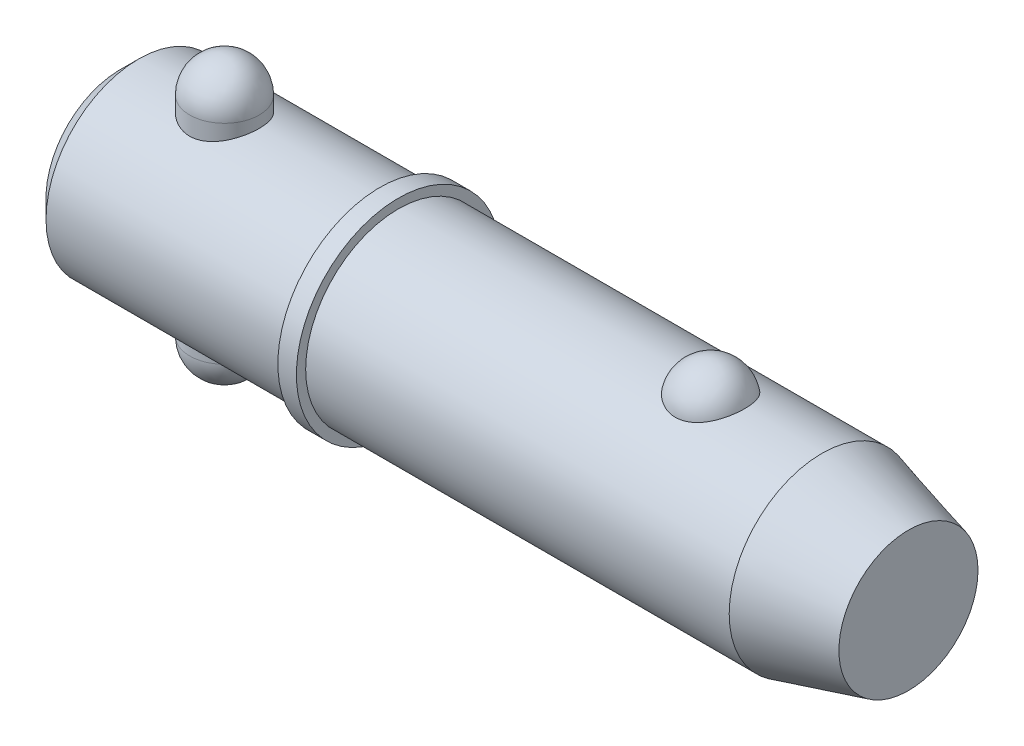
ISO-10303-21;
HEADER;
FILE_DESCRIPTION(('STEP AP214'),'2;1');
FILE_NAME('part.step','',(''),(''),'','','');
FILE_SCHEMA(('AUTOMOTIVE_DESIGN { 1 0 10303 214 1 1 1 1 }'));
ENDSEC;
DATA;
#1=APPLICATION_CONTEXT('core data for automotive mechanical design processes');
#2=APPLICATION_PROTOCOL_DEFINITION('international standard','automotive_design',2000,#1);
#3=PRODUCT_CONTEXT('',#1,'mechanical');
#4=PRODUCT('Part','Part','',(#3));
#5=PRODUCT_RELATED_PRODUCT_CATEGORY('part','',(#4));
#6=PRODUCT_DEFINITION_FORMATION('','',#4);
#7=PRODUCT_DEFINITION_CONTEXT('part definition',#1,'design');
#8=PRODUCT_DEFINITION('design','',#6,#7);
#9=PRODUCT_DEFINITION_SHAPE('','',#8);
#10=(LENGTH_UNIT() NAMED_UNIT(*) SI_UNIT(.MILLI.,.METRE.));
#11=(NAMED_UNIT(*) PLANE_ANGLE_UNIT() SI_UNIT($,.RADIAN.));
#12=(NAMED_UNIT(*) SI_UNIT($,.STERADIAN.) SOLID_ANGLE_UNIT());
#13=UNCERTAINTY_MEASURE_WITH_UNIT(LENGTH_MEASURE(1.E-05),#10,'distance_accuracy_value','');
#14=(GEOMETRIC_REPRESENTATION_CONTEXT(3) GLOBAL_UNCERTAINTY_ASSIGNED_CONTEXT((#13)) GLOBAL_UNIT_ASSIGNED_CONTEXT((#10,
#11,#12)) REPRESENTATION_CONTEXT('',''));
#15=CARTESIAN_POINT('',(0.,0.,0.));
#16=DIRECTION('',(0.,0.,1.));
#17=DIRECTION('',(1.,0.,0.));
#18=AXIS2_PLACEMENT_3D('',#15,#16,#17);
#19=CARTESIAN_POINT('',(14.28,19.05,0.));
#20=DIRECTION('',(0.,-1.,0.));
#21=DIRECTION('',(0.,0.,-1.));
#22=AXIS2_PLACEMENT_3D('',#19,#20,#21);
#23=CYLINDRICAL_SURFACE('',#22,4.76);
#24=CARTESIAN_POINT('',(14.28,-14.29,0.));
#25=DIRECTION('',(0.,-1.,0.));
#26=DIRECTION('',(0.,0.,-1.));
#27=AXIS2_PLACEMENT_3D('',#24,#25,#26);
#28=CIRCLE('',#27,4.76);
#29=CARTESIAN_POINT('',(14.28,-14.29,-4.76));
#30=VERTEX_POINT('',#29);
#31=EDGE_CURVE('P0_E10',#30,#30,#28,.F.);
#32=CARTESIAN_POINT('',(14.28,14.29,0.));
#33=DIRECTION('',(0.,-1.,0.));
#34=DIRECTION('',(0.,0.,-1.));
#35=AXIS2_PLACEMENT_3D('',#32,#33,#34);
#36=CIRCLE('',#35,4.76);
#37=CARTESIAN_POINT('',(14.28,14.29,-4.76));
#38=VERTEX_POINT('',#37);
#39=EDGE_CURVE('P0_E21',#38,#38,#36,.T.);
#40=CARTESIAN_POINT('',(14.28,-14.29,-4.76));
#41=CARTESIAN_POINT('',(14.28,-13.9922916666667,-4.76));
#42=CARTESIAN_POINT('',(14.28,-13.6945833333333,-4.76));
#43=CARTESIAN_POINT('',(14.28,-13.0991666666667,-4.76));
#44=CARTESIAN_POINT('',(14.28,-12.8014583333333,-4.76));
#45=CARTESIAN_POINT('',(14.28,-12.2060416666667,-4.76));
#46=CARTESIAN_POINT('',(14.28,-11.9083333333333,-4.76));
#47=CARTESIAN_POINT('',(14.28,-11.3129166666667,-4.76));
#48=CARTESIAN_POINT('',(14.28,-11.0152083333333,-4.76));
#49=CARTESIAN_POINT('',(14.28,-10.4197916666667,-4.76));
#50=CARTESIAN_POINT('',(14.28,-10.1220833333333,-4.76));
#51=CARTESIAN_POINT('',(14.28,-9.52666666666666,-4.76));
#52=CARTESIAN_POINT('',(14.28,-9.22895833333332,-4.76));
#53=CARTESIAN_POINT('',(14.28,-8.63354166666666,-4.76));
#54=CARTESIAN_POINT('',(14.28,-8.33583333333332,-4.76));
#55=CARTESIAN_POINT('',(14.28,-7.74041666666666,-4.76));
#56=CARTESIAN_POINT('',(14.28,-7.44270833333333,-4.76));
#57=CARTESIAN_POINT('',(14.28,-6.84729166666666,-4.76));
#58=CARTESIAN_POINT('',(14.28,-6.54958333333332,-4.76));
#59=CARTESIAN_POINT('',(14.28,-5.95416666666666,-4.76));
#60=CARTESIAN_POINT('',(14.28,-5.65645833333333,-4.76));
#61=CARTESIAN_POINT('',(14.28,-5.06104166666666,-4.76));
#62=CARTESIAN_POINT('',(14.28,-4.76333333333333,-4.76));
#63=CARTESIAN_POINT('',(14.28,-4.16791666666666,-4.76));
#64=CARTESIAN_POINT('',(14.28,-3.87020833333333,-4.76));
#65=CARTESIAN_POINT('',(14.28,-3.27479166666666,-4.76));
#66=CARTESIAN_POINT('',(14.28,-2.97708333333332,-4.76));
#67=CARTESIAN_POINT('',(14.28,-2.38166666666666,-4.76));
#68=CARTESIAN_POINT('',(14.28,-2.08395833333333,-4.76));
#69=CARTESIAN_POINT('',(14.28,-1.48854166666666,-4.76));
#70=CARTESIAN_POINT('',(14.28,-1.19083333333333,-4.76));
#71=CARTESIAN_POINT('',(14.28,-0.595416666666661,-4.76));
#72=CARTESIAN_POINT('',(14.28,-0.297708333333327,-4.76));
#73=CARTESIAN_POINT('',(14.28,0.297708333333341,-4.76));
#74=CARTESIAN_POINT('',(14.28,0.595416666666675,-4.76));
#75=CARTESIAN_POINT('',(14.28,1.19083333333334,-4.76));
#76=CARTESIAN_POINT('',(14.28,1.48854166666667,-4.76));
#77=CARTESIAN_POINT('',(14.28,2.08395833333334,-4.76));
#78=CARTESIAN_POINT('',(14.28,2.38166666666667,-4.76));
#79=CARTESIAN_POINT('',(14.28,2.97708333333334,-4.76));
#80=CARTESIAN_POINT('',(14.28,3.27479166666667,-4.76));
#81=CARTESIAN_POINT('',(14.28,3.87020833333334,-4.76));
#82=CARTESIAN_POINT('',(14.28,4.16791666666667,-4.76));
#83=CARTESIAN_POINT('',(14.28,4.76333333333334,-4.76));
#84=CARTESIAN_POINT('',(14.28,5.06104166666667,-4.76));
#85=CARTESIAN_POINT('',(14.28,5.65645833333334,-4.76));
#86=CARTESIAN_POINT('',(14.28,5.95416666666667,-4.76));
#87=CARTESIAN_POINT('',(14.28,6.54958333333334,-4.76));
#88=CARTESIAN_POINT('',(14.28,6.84729166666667,-4.76));
#89=CARTESIAN_POINT('',(14.28,7.44270833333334,-4.76));
#90=CARTESIAN_POINT('',(14.28,7.74041666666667,-4.76));
#91=CARTESIAN_POINT('',(14.28,8.33583333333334,-4.76));
#92=CARTESIAN_POINT('',(14.28,8.63354166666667,-4.76));
#93=CARTESIAN_POINT('',(14.28,9.22895833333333,-4.76));
#94=CARTESIAN_POINT('',(14.28,9.52666666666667,-4.76));
#95=CARTESIAN_POINT('',(14.28,10.1220833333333,-4.76));
#96=CARTESIAN_POINT('',(14.28,10.4197916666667,-4.76));
#97=CARTESIAN_POINT('',(14.28,11.0152083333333,-4.76));
#98=CARTESIAN_POINT('',(14.28,11.3129166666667,-4.76));
#99=CARTESIAN_POINT('',(14.28,11.9083333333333,-4.76));
#100=CARTESIAN_POINT('',(14.28,12.2060416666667,-4.76));
#101=CARTESIAN_POINT('',(14.28,12.8014583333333,-4.76));
#102=CARTESIAN_POINT('',(14.28,13.0991666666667,-4.76));
#103=CARTESIAN_POINT('',(14.28,13.6945833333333,-4.76));
#104=CARTESIAN_POINT('',(14.28,13.9922916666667,-4.76));
#105=CARTESIAN_POINT('',(14.28,14.29,-4.76));
#106=B_SPLINE_CURVE_WITH_KNOTS('',3,(#40,#41,#42,#43,#44,#45,#46,#47,#48,#49,#50,#51,#52,#53,
#54,#55,#56,#57,#58,#59,#60,#61,#62,#63,#64,#65,#66,#67,#68,#69,#70,#71,#72,#73,#74,#75,#76,#77,
#78,#79,#80,#81,#82,#83,#84,#85,#86,#87,#88,#89,#90,#91,#92,#93,#94,#95,#96,#97,#98,#99,#100,
#101,#102,#103,#104,#105),.UNSPECIFIED.,.F.,.F.,(4,2,2,2,2,2,2,2,2,2,2,2,2,2,2,2,2,2,2,2,2,2,2,
2,2,2,2,2,2,2,2,2,4),(0.,0.893125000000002,1.78625,2.67937499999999,3.5725,4.465625,5.35875,
6.25187499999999,7.145,8.038125,8.93125,9.82437499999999,10.7175,11.610625,12.50375,13.396875,
14.29,15.183125,16.07625,16.969375,17.8625,18.755625,19.64875,20.541875,21.435,22.328125,
23.22125,24.114375,25.0075,25.900625,26.79375,27.686875,28.58),.UNSPECIFIED.);
#107=EDGE_CURVE('P0_BSEAM14',#30,#38,#106,.T.);
#108=ORIENTED_EDGE('',*,*,#31,.T.);
#109=ORIENTED_EDGE('',*,*,#39,.T.);
#110=ORIENTED_EDGE('',*,*,#107,.T.);
#111=ORIENTED_EDGE('',*,*,#107,.F.);
#112=EDGE_LOOP('',(#108,#110,#109,#111));
#113=FACE_BOUND('',#112,.T.);
#114=ADVANCED_FACE('P0_F14',(#113),#23,.T.);
#115=CARTESIAN_POINT('',(14.28,-14.29,0.));
#116=DIRECTION('',(0.,0.,1.));
#117=DIRECTION('',(1.,0.,0.));
#118=AXIS2_PLACEMENT_3D('',#115,#116,#117);
#119=SPHERICAL_SURFACE('',#118,4.76);
#120=CARTESIAN_POINT('',(14.28,-14.29,0.));
#121=DIRECTION('',(0.,-1.,0.));
#122=DIRECTION('',(0.,0.,-1.));
#123=AXIS2_PLACEMENT_3D('',#120,#121,#122);
#124=SPHERICAL_SURFACE('',#123,4.76);
#125=ORIENTED_EDGE('',*,*,#31,.F.);
#126=EDGE_LOOP('',(#125));
#127=FACE_BOUND('',#126,.T.);
#128=ADVANCED_FACE('P0_F29',(#127),#124,.T.);
#129=CARTESIAN_POINT('',(14.28,14.29,0.));
#130=DIRECTION('',(0.,0.,1.));
#131=DIRECTION('',(1.,0.,0.));
#132=AXIS2_PLACEMENT_3D('',#129,#130,#131);
#133=SPHERICAL_SURFACE('',#132,4.76);
#134=CARTESIAN_POINT('',(14.28,14.29,0.));
#135=DIRECTION('',(0.,-1.,0.));
#136=DIRECTION('',(0.,0.,-1.));
#137=AXIS2_PLACEMENT_3D('',#134,#135,#136);
#138=SPHERICAL_SURFACE('',#137,4.76);
#139=ORIENTED_EDGE('',*,*,#39,.F.);
#140=EDGE_LOOP('',(#139));
#141=FACE_BOUND('',#140,.T.);
#142=ADVANCED_FACE('P0_F16',(#141),#138,.T.);
#143=CLOSED_SHELL('',(#114,#128,#142));
#144=MANIFOLD_SOLID_BREP('P0_B1',#143);
#145=CARTESIAN_POINT('',(0.,0.,0.));
#146=DIRECTION('',(1.,0.,0.));
#147=DIRECTION('',(0.,0.,-1.));
#148=AXIS2_PLACEMENT_3D('',#145,#146,#147);
#149=CYLINDRICAL_SURFACE('',#148,12.7);
#150=CARTESIAN_POINT('',(96.1007386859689,0.,0.));
#151=DIRECTION('',(1.,0.,0.));
#152=DIRECTION('',(0.,0.,-1.));
#153=AXIS2_PLACEMENT_3D('',#150,#151,#152);
#154=CIRCLE('',#153,12.7);
#155=CARTESIAN_POINT('',(96.1007386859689,0.,-12.7));
#156=VERTEX_POINT('',#155);
#157=EDGE_CURVE('P1_E81',#156,#156,#154,.T.);
#158=ORIENTED_EDGE('',*,*,#157,.F.);
#159=EDGE_LOOP('',(#158));
#160=FACE_BOUND('',#159,.T.);
#161=CARTESIAN_POINT('',(38.1,0.,0.));
#162=DIRECTION('',(1.,0.,0.));
#163=DIRECTION('',(0.,0.,-1.));
#164=AXIS2_PLACEMENT_3D('',#161,#162,#163);
#165=CIRCLE('',#164,12.7);
#166=CARTESIAN_POINT('',(38.1,0.,-12.7));
#167=VERTEX_POINT('',#166);
#168=EDGE_CURVE('P1_E85',#167,#167,#165,.T.);
#169=ORIENTED_EDGE('',*,*,#168,.T.);
#170=EDGE_LOOP('',(#169));
#171=FACE_BOUND('',#170,.T.);
#172=CARTESIAN_POINT('',(80.8600429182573,11.7500437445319,4.81938502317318));
#173=CARTESIAN_POINT('',(80.7350881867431,11.7500430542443,4.81938571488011));
#174=CARTESIAN_POINT('',(80.610144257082,11.7520975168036,4.81438658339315));
#175=CARTESIAN_POINT('',(80.3611425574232,11.760253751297,4.79442904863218));
#176=CARTESIAN_POINT('',(80.2370850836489,11.7663568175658,4.77946746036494));
#177=CARTESIAN_POINT('',(79.9909016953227,11.7824262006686,4.73971414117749));
#178=CARTESIAN_POINT('',(79.8687744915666,11.7923898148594,4.71492928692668));
#179=CARTESIAN_POINT('',(79.6271874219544,11.8158938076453,4.65571340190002));
#180=CARTESIAN_POINT('',(79.5077285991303,11.8294355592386,4.6212786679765));
#181=CARTESIAN_POINT('',(79.2725578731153,11.8596812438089,4.54309502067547));
#182=CARTESIAN_POINT('',(79.1568393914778,11.8763792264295,4.49936361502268));
#183=CARTESIAN_POINT('',(78.9296530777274,11.9124878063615,4.40287235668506));
#184=CARTESIAN_POINT('',(78.8181868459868,11.9318994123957,4.35010914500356));
#185=CARTESIAN_POINT('',(78.4912782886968,11.9934256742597,4.17881316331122));
#186=CARTESIAN_POINT('',(78.2831270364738,12.038858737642,4.04720756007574));
#187=CARTESIAN_POINT('',(77.8858509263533,12.1352173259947,3.748564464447));
#188=CARTESIAN_POINT('',(77.6974438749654,12.1862630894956,3.58061821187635));
#189=CARTESIAN_POINT('',(77.3505213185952,12.2875163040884,3.21600758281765));
#190=CARTESIAN_POINT('',(77.1920113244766,12.3377235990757,3.0193379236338));
#191=CARTESIAN_POINT('',(76.9016887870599,12.4344923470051,2.592916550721));
#192=CARTESIAN_POINT('',(76.7713762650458,12.4807925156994,2.36208286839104));
#193=CARTESIAN_POINT('',(76.5494079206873,12.5623454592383,1.88070399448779));
#194=CARTESIAN_POINT('',(76.4577554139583,12.5975972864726,1.63015711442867));
#195=CARTESIAN_POINT('',(76.3140466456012,12.6538414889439,1.1129886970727));
#196=CARTESIAN_POINT('',(76.2624990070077,12.6746503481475,0.846205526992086));
#197=CARTESIAN_POINT('',(76.2019771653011,12.699153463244,0.307085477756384));
#198=CARTESIAN_POINT('',(76.1930018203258,12.7028481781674,0.034748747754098));
#199=CARTESIAN_POINT('',(76.2177310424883,12.6927785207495,-0.506073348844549));
#200=CARTESIAN_POINT('',(76.2511899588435,12.6791146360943,-0.774571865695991));
#201=CARTESIAN_POINT('',(76.3596877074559,12.635882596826,-1.30170246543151));
#202=CARTESIAN_POINT('',(76.4347272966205,12.606314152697,-1.5603343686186));
#203=CARTESIAN_POINT('',(76.6250000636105,12.5342328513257,-2.06083899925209));
#204=CARTESIAN_POINT('',(76.7402872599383,12.4917026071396,-2.3026886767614));
#205=CARTESIAN_POINT('',(77.0087044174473,12.3981123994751,-2.76259600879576));
#206=CARTESIAN_POINT('',(77.1618374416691,12.3470517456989,-2.98065173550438));
#207=CARTESIAN_POINT('',(77.5035077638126,12.2416045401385,-3.38786328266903));
#208=CARTESIAN_POINT('',(77.6922017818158,12.1872040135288,-3.57688418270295));
#209=CARTESIAN_POINT('',(78.1002392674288,12.0814086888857,-3.91941073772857));
#210=CARTESIAN_POINT('',(78.3195800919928,12.0300136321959,-4.07291945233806));
#211=CARTESIAN_POINT('',(78.7783753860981,11.9373542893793,-4.33691289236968));
#212=CARTESIAN_POINT('',(79.0173044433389,11.8958982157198,-4.44824125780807));
#213=CARTESIAN_POINT('',(79.5124376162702,11.8268116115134,-4.62881985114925));
#214=CARTESIAN_POINT('',(79.7686351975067,11.7991758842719,-4.69808589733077));
#215=CARTESIAN_POINT('',(80.2771640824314,11.7622209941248,-4.78983181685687));
#216=CARTESIAN_POINT('',(80.5290414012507,11.7520502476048,-4.81449025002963));
#217=CARTESIAN_POINT('',(81.0335734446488,11.7485796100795,-4.82295735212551));
#218=CARTESIAN_POINT('',(81.2862280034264,11.7552763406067,-4.80677420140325));
#219=CARTESIAN_POINT('',(81.7768341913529,11.7842584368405,-4.73525430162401));
#220=CARTESIAN_POINT('',(82.0149984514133,11.8060486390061,-4.68116061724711));
#221=CARTESIAN_POINT('',(82.4784894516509,11.8622750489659,-4.53678133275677));
#222=CARTESIAN_POINT('',(82.7038151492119,11.8967122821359,-4.44649279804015));
#223=CARTESIAN_POINT('',(83.1408018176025,11.9754603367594,-4.2298761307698));
#224=CARTESIAN_POINT('',(83.3520579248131,12.0199699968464,-4.10280539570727));
#225=CARTESIAN_POINT('',(83.7506012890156,12.1138028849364,-3.81685409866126));
#226=CARTESIAN_POINT('',(83.9378830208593,12.163127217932,-3.65796622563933));
#227=CARTESIAN_POINT('',(84.2933509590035,12.2642343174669,-3.30364864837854));
#228=CARTESIAN_POINT('',(84.4601119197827,12.3160165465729,-3.10678783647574));
#229=CARTESIAN_POINT('',(84.7595799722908,12.4142566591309,-2.68748409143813));
#230=CARTESIAN_POINT('',(84.8922809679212,12.4607135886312,-2.46503658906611));
#231=CARTESIAN_POINT('',(85.1246912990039,12.5450236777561,-1.99289519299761));
#232=CARTESIAN_POINT('',(85.223215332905,12.5825557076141,-1.7425591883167));
#233=CARTESIAN_POINT('',(85.3792277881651,12.6431720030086,-1.22773734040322));
#234=CARTESIAN_POINT('',(85.4367157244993,12.6662560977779,-0.963251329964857));
#235=CARTESIAN_POINT('',(85.5095441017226,12.6956486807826,-0.427355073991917));
#236=CARTESIAN_POINT('',(85.5248378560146,12.7019385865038,-0.1559374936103));
#237=CARTESIAN_POINT('',(85.5127794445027,12.6970201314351,0.385928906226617));
#238=CARTESIAN_POINT('',(85.4854280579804,12.6858120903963,0.656377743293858));
#239=CARTESIAN_POINT('',(85.4130609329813,12.6568455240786,1.05454017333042));
#240=CARTESIAN_POINT('',(85.3837963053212,12.6451962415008,1.18577850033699));
#241=CARTESIAN_POINT('',(85.3150228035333,12.6181819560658,1.4451380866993));
#242=CARTESIAN_POINT('',(85.2755176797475,12.6028183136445,1.57326046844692));
#243=CARTESIAN_POINT('',(85.1864397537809,12.5687547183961,1.82554978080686));
#244=CARTESIAN_POINT('',(85.1368627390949,12.5500533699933,1.9497150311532));
#245=CARTESIAN_POINT('',(85.0279211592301,12.5098093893,2.19314370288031));
#246=CARTESIAN_POINT('',(84.9685601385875,12.4882677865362,2.31240887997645));
#247=CARTESIAN_POINT('',(84.8399712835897,12.4427679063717,2.54593031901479));
#248=CARTESIAN_POINT('',(84.7706888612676,12.4187964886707,2.66015396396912));
#249=CARTESIAN_POINT('',(84.622903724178,12.3691892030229,2.88202659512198));
#250=CARTESIAN_POINT('',(84.5444044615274,12.3435539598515,2.98967802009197));
#251=CARTESIAN_POINT('',(84.3785502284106,12.2912955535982,3.19774385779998));
#252=CARTESIAN_POINT('',(84.2911918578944,12.2646720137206,3.29815546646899));
#253=CARTESIAN_POINT('',(84.1081617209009,12.2111945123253,3.49095035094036));
#254=CARTESIAN_POINT('',(84.0124932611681,12.1843406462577,3.58333679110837));
#255=CARTESIAN_POINT('',(83.8136272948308,12.1312249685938,3.75922876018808));
#256=CARTESIAN_POINT('',(83.7104503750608,12.104961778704,3.84275713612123));
#257=CARTESIAN_POINT('',(83.4970133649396,12.0537284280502,4.00056406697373));
#258=CARTESIAN_POINT('',(83.3867562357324,12.028757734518,4.07484645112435));
#259=CARTESIAN_POINT('',(83.1597550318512,11.9808306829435,4.21367959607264));
#260=CARTESIAN_POINT('',(83.0430068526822,11.9578756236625,4.27822410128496));
#261=CARTESIAN_POINT('',(82.8039425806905,11.9147184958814,4.39698483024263));
#262=CARTESIAN_POINT('',(82.6816287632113,11.894515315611,4.45120522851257));
#263=CARTESIAN_POINT('',(82.422952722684,11.8561129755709,4.55255353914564));
#264=CARTESIAN_POINT('',(82.2862237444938,11.8381764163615,4.59884858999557));
#265=CARTESIAN_POINT('',(82.0086087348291,11.8069093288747,4.67853897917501));
#266=CARTESIAN_POINT('',(81.8677245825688,11.7935767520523,4.71194005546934));
#267=CARTESIAN_POINT('',(81.5830944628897,11.7720277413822,4.76552188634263));
#268=CARTESIAN_POINT('',(81.4393488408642,11.7638106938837,4.78570422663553));
#269=CARTESIAN_POINT('',(81.1504114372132,11.7528195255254,4.81263433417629));
#270=CARTESIAN_POINT('',(81.0052198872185,11.7500445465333,4.81938421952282));
#271=CARTESIAN_POINT('',(80.8600429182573,11.7500437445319,4.81938502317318));
#272=B_SPLINE_CURVE_WITH_KNOTS('',3,(#172,#173,#174,#175,#176,#177,#178,#179,#180,#181,#182,
#183,#184,#185,#186,#187,#188,#189,#190,#191,#192,#193,#194,#195,#196,#197,#198,#199,#200,#201,
#202,#203,#204,#205,#206,#207,#208,#209,#210,#211,#212,#213,#214,#215,#216,#217,#218,#219,#220,
#221,#222,#223,#224,#225,#226,#227,#228,#229,#230,#231,#232,#233,#234,#235,#236,#237,#238,#239,
#240,#241,#242,#243,#244,#245,#246,#247,#248,#249,#250,#251,#252,#253,#254,#255,#256,#257,#258,
#259,#260,#261,#262,#263,#264,#265,#266,#267,#268,#269,#270,#271),.UNSPECIFIED.,.T.,.F.,(4,2,2,
2,2,2,2,2,2,2,2,2,2,2,2,2,2,2,2,2,2,2,2,2,2,2,2,2,2,2,2,2,2,2,2,2,2,2,2,2,2,2,2,2,2,2,2,2,2,4),
(0.,0.374729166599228,0.749578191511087,1.12416526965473,1.49889629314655,1.87292776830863,
2.24709865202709,2.99481328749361,3.76399449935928,4.53331735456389,5.33683915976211,
6.14042986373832,6.95405296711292,7.76765424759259,8.57656703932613,9.38549455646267,
10.1955119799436,11.0055949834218,11.8193353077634,12.6330054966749,13.4294141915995,
14.2255231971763,14.9815786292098,15.7374826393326,16.4696948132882,17.2019663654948,
17.9501979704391,18.6986017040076,19.484470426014,20.2704797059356,21.0815215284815,
21.8925729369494,22.7045213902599,23.5164550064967,23.9209608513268,24.3253187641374,
24.7298461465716,25.1342272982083,25.54092555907,25.9474719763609,26.3541750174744,
26.7607169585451,27.1661834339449,27.5714814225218,27.9770386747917,28.3824315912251,
28.8181206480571,29.2536155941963,29.6890582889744,30.1244323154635),.UNSPECIFIED.);
#273=CARTESIAN_POINT('',(80.8600429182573,11.7500437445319,4.81938502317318));
#274=VERTEX_POINT('',#273);
#275=EDGE_CURVE('P1_E35',#274,#274,#272,.T.);
#276=ORIENTED_EDGE('',*,*,#275,.T.);
#277=EDGE_LOOP('',(#276));
#278=FACE_BOUND('',#277,.T.);
#279=ADVANCED_FACE('P1_F13',(#160,#171,#278),#149,.T.);
#280=CARTESIAN_POINT('',(0.,0.,0.));
#281=DIRECTION('',(-1.,0.,0.));
#282=DIRECTION('',(0.,0.,1.));
#283=AXIS2_PLACEMENT_3D('',#280,#281,#282);
#284=PLANE('',#283);
#285=CARTESIAN_POINT('',(0.,0.,0.));
#286=DIRECTION('',(1.,0.,0.));
#287=DIRECTION('',(0.,0.,-1.));
#288=AXIS2_PLACEMENT_3D('',#285,#286,#287);
#289=CIRCLE('',#288,10.16);
#290=CARTESIAN_POINT('',(0.,0.,-10.16));
#291=VERTEX_POINT('',#290);
#292=EDGE_CURVE('P1_E9',#291,#291,#289,.T.);
#293=ORIENTED_EDGE('',*,*,#292,.F.);
#294=EDGE_LOOP('',(#293));
#295=FACE_BOUND('',#294,.T.);
#296=ADVANCED_FACE('P1_F15',(#295),#284,.T.);
#297=CARTESIAN_POINT('',(2.53999999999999,0.,0.));
#298=DIRECTION('',(1.,0.,0.));
#299=DIRECTION('',(0.,0.,-1.));
#300=AXIS2_PLACEMENT_3D('',#297,#298,#299);
#301=CONICAL_SURFACE('',#300,12.7,0.78539816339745);
#302=ORIENTED_EDGE('',*,*,#292,.T.);
#303=EDGE_LOOP('',(#302));
#304=FACE_BOUND('',#303,.T.);
#305=CARTESIAN_POINT('',(2.53999999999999,0.,0.));
#306=DIRECTION('',(1.,0.,0.));
#307=DIRECTION('',(0.,0.,-1.));
#308=AXIS2_PLACEMENT_3D('',#305,#306,#307);
#309=CIRCLE('',#308,12.7);
#310=CARTESIAN_POINT('',(2.53999999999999,0.,-12.7));
#311=VERTEX_POINT('',#310);
#312=EDGE_CURVE('P1_E26',#311,#311,#309,.T.);
#313=ORIENTED_EDGE('',*,*,#312,.F.);
#314=EDGE_LOOP('',(#313));
#315=FACE_BOUND('',#314,.T.);
#316=ADVANCED_FACE('P1_F77',(#304,#315),#301,.T.);
#317=CARTESIAN_POINT('',(0.,0.,0.));
#318=DIRECTION('',(1.,0.,0.));
#319=DIRECTION('',(0.,0.,-1.));
#320=AXIS2_PLACEMENT_3D('',#317,#318,#319);
#321=CYLINDRICAL_SURFACE('',#320,12.7);
#322=CARTESIAN_POINT('',(14.28,-11.7742260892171,4.76));
#323=CARTESIAN_POINT('',(14.1514948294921,-11.7742255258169,4.76000061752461));
#324=CARTESIAN_POINT('',(14.0229980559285,-11.7763355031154,4.75479194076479));
#325=CARTESIAN_POINT('',(13.7669369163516,-11.7847043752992,4.73401198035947));
#326=CARTESIAN_POINT('',(13.6393728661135,-11.7909646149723,4.71843733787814));
#327=CARTESIAN_POINT('',(13.386226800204,-11.8074248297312,4.67709434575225));
#328=CARTESIAN_POINT('',(13.2606439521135,-11.8176231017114,4.65133040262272));
#329=CARTESIAN_POINT('',(13.0122434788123,-11.8416347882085,4.58985545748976));
#330=CARTESIAN_POINT('',(12.8894269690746,-11.8554496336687,4.55414051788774));
#331=CARTESIAN_POINT('',(12.6477622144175,-11.8862222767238,4.47320764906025));
#332=CARTESIAN_POINT('',(12.5289037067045,-11.9031710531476,4.4280169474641));
#333=CARTESIAN_POINT('',(12.2955059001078,-11.939736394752,4.32845291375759));
#334=CARTESIAN_POINT('',(12.1809682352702,-11.9593539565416,4.2740761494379));
#335=CARTESIAN_POINT('',(11.8448901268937,-12.0213893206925,4.09777237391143));
#336=CARTESIAN_POINT('',(11.6307077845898,-12.0670135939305,3.9626122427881));
#337=CARTESIAN_POINT('',(11.2179129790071,-12.1641514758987,3.65386230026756));
#338=CARTESIAN_POINT('',(11.0204399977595,-12.2158379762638,3.47881300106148));
#339=CARTESIAN_POINT('',(10.6568212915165,-12.3178468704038,3.09829182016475));
#340=CARTESIAN_POINT('',(10.4906822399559,-12.3681689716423,2.89281347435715));
#341=CARTESIAN_POINT('',(10.1890299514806,-12.4638367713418,2.44867909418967));
#342=CARTESIAN_POINT('',(10.054749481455,-12.5089552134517,2.20913281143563));
#343=CARTESIAN_POINT('',(9.82886079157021,-12.5870472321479,1.70885919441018));
#344=CARTESIAN_POINT('',(9.73723778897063,-12.620025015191,1.44813923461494));
#345=CARTESIAN_POINT('',(9.60324488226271,-12.6688874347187,0.9248423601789));
#346=CARTESIAN_POINT('',(9.55892269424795,-12.6854474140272,0.662829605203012));
#347=CARTESIAN_POINT('',(9.5145335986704,-12.7020320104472,0.134596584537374));
#348=CARTESIAN_POINT('',(9.5144523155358,-12.7020619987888,-0.131622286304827));
#349=CARTESIAN_POINT('',(9.55741019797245,-12.6860129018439,-0.646717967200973));
#350=CARTESIAN_POINT('',(9.59831845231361,-12.6707298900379,-0.895801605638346));
#351=CARTESIAN_POINT('',(9.71850987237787,-12.6268158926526,-1.38327219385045));
#352=CARTESIAN_POINT('',(9.79779575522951,-12.5981839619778,-1.62165838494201));
#353=CARTESIAN_POINT('',(9.99348296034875,-12.5298894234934,-2.08508424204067));
#354=CARTESIAN_POINT('',(10.110407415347,-12.4900724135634,-2.30987931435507));
#355=CARTESIAN_POINT('',(10.3775896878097,-12.4034373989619,-2.7372158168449));
#356=CARTESIAN_POINT('',(10.5278582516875,-12.3566171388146,-2.93975004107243));
#357=CARTESIAN_POINT('',(10.8677318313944,-12.257571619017,-3.32936830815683));
#358=CARTESIAN_POINT('',(11.0591227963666,-12.2051903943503,-3.51485714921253));
#359=CARTESIAN_POINT('',(11.4706087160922,-12.1031155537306,-3.85170663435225));
#360=CARTESIAN_POINT('',(11.6907108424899,-12.0534226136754,-4.00305872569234));
#361=CARTESIAN_POINT('',(12.1596597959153,-11.9613684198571,-4.27038218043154));
#362=CARTESIAN_POINT('',(12.4090353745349,-11.9191939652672,-4.38549550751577));
#363=CARTESIAN_POINT('',(12.9256290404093,-11.8491124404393,-4.57149117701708));
#364=CARTESIAN_POINT('',(13.1928371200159,-11.8211974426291,-4.64239810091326));
#365=CARTESIAN_POINT('',(13.7217488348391,-11.7846654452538,-4.73434137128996));
#366=CARTESIAN_POINT('',(13.9829438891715,-11.7750694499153,-4.75791141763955));
#367=CARTESIAN_POINT('',(14.5056760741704,-11.7734909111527,-4.76182097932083));
#368=CARTESIAN_POINT('',(14.7672131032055,-11.7815039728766,-4.74217128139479));
#369=CARTESIAN_POINT('',(15.2702140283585,-11.8132466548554,-4.66249544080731));
#370=CARTESIAN_POINT('',(15.5120417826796,-11.8362133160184,-4.60442726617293));
#371=CARTESIAN_POINT('',(15.9824097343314,-11.8943704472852,-4.45202868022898));
#372=CARTESIAN_POINT('',(16.2109472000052,-11.9295634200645,-4.35769084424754));
#373=CARTESIAN_POINT('',(16.6577741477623,-12.0098310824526,-4.13144368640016));
#374=CARTESIAN_POINT('',(16.8753590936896,-12.055226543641,-3.99825937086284));
#375=CARTESIAN_POINT('',(17.2859732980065,-12.150238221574,-3.69949845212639));
#376=CARTESIAN_POINT('',(17.4789935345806,-12.19985597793,-3.5339100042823));
#377=CARTESIAN_POINT('',(17.8477707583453,-12.3015434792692,-3.1624728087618));
#378=CARTESIAN_POINT('',(18.0216609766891,-12.3535695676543,-2.95473880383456));
#379=CARTESIAN_POINT('',(18.254545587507,-12.426745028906,-2.62277433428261));
#380=CARTESIAN_POINT('',(18.3275489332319,-12.4503382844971,-2.50865480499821));
#381=CARTESIAN_POINT('',(18.463723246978,-12.4952713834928,-2.27428971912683));
#382=CARTESIAN_POINT('',(18.5268984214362,-12.5166121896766,-2.15404681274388));
#383=CARTESIAN_POINT('',(18.6427140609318,-12.5563817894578,-1.90858448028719));
#384=CARTESIAN_POINT('',(18.6953855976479,-12.5748191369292,-1.78338108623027));
#385=CARTESIAN_POINT('',(18.7899337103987,-12.6083284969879,-1.52857834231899));
#386=CARTESIAN_POINT('',(18.8318147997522,-12.6234019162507,-1.39898085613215));
#387=CARTESIAN_POINT('',(18.9043819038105,-12.6497495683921,-1.13633254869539));
#388=CARTESIAN_POINT('',(18.9350698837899,-12.6610244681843,-1.00328233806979));
#389=CARTESIAN_POINT('',(18.9849303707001,-12.6794412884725,-0.734761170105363));
#390=CARTESIAN_POINT('',(19.0041035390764,-12.6865834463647,-0.59929035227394));
#391=CARTESIAN_POINT('',(19.0299427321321,-12.6962286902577,-0.335006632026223));
#392=CARTESIAN_POINT('',(19.0372742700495,-12.698978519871,-0.206267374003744));
#393=CARTESIAN_POINT('',(19.0414668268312,-12.7005496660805,0.0514515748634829));
#394=CARTESIAN_POINT('',(19.038324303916,-12.69936965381,0.180431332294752));
#395=CARTESIAN_POINT('',(19.0215965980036,-12.6931114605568,0.437551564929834));
#396=CARTESIAN_POINT('',(19.0080165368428,-12.6880351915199,0.565692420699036));
#397=CARTESIAN_POINT('',(18.9705519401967,-12.6741222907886,0.820297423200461));
#398=CARTESIAN_POINT('',(18.9466635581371,-12.665284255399,0.946760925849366));
#399=CARTESIAN_POINT('',(18.8895279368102,-12.6443449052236,1.19395899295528));
#400=CARTESIAN_POINT('',(18.8565273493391,-12.6323299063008,1.3147578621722));
#401=CARTESIAN_POINT('',(18.781239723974,-12.6052503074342,1.55308888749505));
#402=CARTESIAN_POINT('',(18.738949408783,-12.5901846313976,1.67061987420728));
#403=CARTESIAN_POINT('',(18.5986461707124,-12.5409473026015,2.01714406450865));
#404=CARTESIAN_POINT('',(18.4871532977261,-12.502717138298,2.24027279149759));
#405=CARTESIAN_POINT('',(18.2262440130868,-12.4173042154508,2.6742599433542));
#406=CARTESIAN_POINT('',(18.0754310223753,-12.3698127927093,2.88420891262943));
#407=CARTESIAN_POINT('',(17.7421836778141,-12.271667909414,3.27675114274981));
#408=CARTESIAN_POINT('',(17.5597380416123,-12.2210133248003,3.45933459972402));
#409=CARTESIAN_POINT('',(17.2605468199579,-12.1452079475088,3.7138066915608));
#410=CARTESIAN_POINT('',(17.1535518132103,-12.119328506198,3.79719993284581));
#411=CARTESIAN_POINT('',(16.9326449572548,-12.0688597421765,3.95467398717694));
#412=CARTESIAN_POINT('',(16.8187356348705,-12.0442699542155,4.02875817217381));
#413=CARTESIAN_POINT('',(16.5846234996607,-11.9971053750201,4.16711104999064));
#414=CARTESIAN_POINT('',(16.4644172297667,-11.9745317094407,4.23137427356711));
#415=CARTESIAN_POINT('',(16.2185866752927,-11.9321360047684,4.34949041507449));
#416=CARTESIAN_POINT('',(16.09296473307,-11.9123127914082,4.40334777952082));
#417=CARTESIAN_POINT('',(15.8314769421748,-11.875268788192,4.50232278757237));
#418=CARTESIAN_POINT('',(15.6954035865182,-11.8582009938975,4.54695127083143));
#419=CARTESIAN_POINT('',(15.4194002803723,-11.8284328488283,4.62383807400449));
#420=CARTESIAN_POINT('',(15.2794720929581,-11.815730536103,4.6561019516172));
#421=CARTESIAN_POINT('',(14.9969657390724,-11.7951940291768,4.70788444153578));
#422=CARTESIAN_POINT('',(14.8543884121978,-11.7873583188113,4.72740702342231));
#423=CARTESIAN_POINT('',(14.5678704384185,-11.7768749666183,4.75346370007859));
#424=CARTESIAN_POINT('',(14.4239299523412,-11.7742267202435,4.75999930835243));
#425=CARTESIAN_POINT('',(14.28,-11.7742260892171,4.76));
#426=B_SPLINE_CURVE_WITH_KNOTS('',3,(#322,#323,#324,#325,#326,#327,#328,#329,#330,#331,#332,
#333,#334,#335,#336,#337,#338,#339,#340,#341,#342,#343,#344,#345,#346,#347,#348,#349,#350,#351,
#352,#353,#354,#355,#356,#357,#358,#359,#360,#361,#362,#363,#364,#365,#366,#367,#368,#369,#370,
#371,#372,#373,#374,#375,#376,#377,#378,#379,#380,#381,#382,#383,#384,#385,#386,#387,#388,#389,
#390,#391,#392,#393,#394,#395,#396,#397,#398,#399,#400,#401,#402,#403,#404,#405,#406,#407,#408,
#409,#410,#411,#412,#413,#414,#415,#416,#417,#418,#419,#420,#421,#422,#423,#424,#425),
.UNSPECIFIED.,.T.,.F.,(4,2,2,2,2,2,2,2,2,2,2,2,2,2,2,2,2,2,2,2,2,2,2,2,2,2,2,2,2,2,2,2,2,2,2,2,
2,2,2,2,2,2,2,2,2,2,2,2,2,2,2,4),(0.,0.385378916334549,0.770882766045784,1.15622008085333,
1.54171009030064,1.92610725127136,2.31064835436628,3.07917291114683,3.88239385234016,
4.68578566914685,5.51648193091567,6.34689010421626,7.14151420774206,7.93588010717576,
8.69098665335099,9.44614666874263,10.2122918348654,10.9786842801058,11.789876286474,
12.6012713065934,13.4306405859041,14.2595482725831,15.0427613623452,15.8257790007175,
16.5716820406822,17.3177378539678,18.0917395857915,18.8660247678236,19.6893332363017,
20.1014571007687,20.5134040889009,20.9241137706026,21.3346513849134,21.7451168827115,
22.1555587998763,22.542011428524,22.928594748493,23.3149884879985,23.7015265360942,
24.0784835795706,24.4555738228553,25.2091300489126,25.994347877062,26.7798463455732,
27.1937428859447,27.6074890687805,28.0214648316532,28.4352633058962,28.8672794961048,
29.299101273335,29.7307884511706,30.1624253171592),.UNSPECIFIED.);
#427=CARTESIAN_POINT('',(14.28,-11.7742260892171,4.76));
#428=VERTEX_POINT('',#427);
#429=EDGE_CURVE('P1_E17',#428,#428,#426,.T.);
#430=ORIENTED_EDGE('',*,*,#429,.F.);
#431=EDGE_LOOP('',(#430));
#432=FACE_BOUND('',#431,.T.);
#433=CARTESIAN_POINT('',(14.28,11.7742260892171,4.76));
#434=CARTESIAN_POINT('',(14.4085051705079,11.7742255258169,4.76000061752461));
#435=CARTESIAN_POINT('',(14.5370019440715,11.7763355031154,4.75479194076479));
#436=CARTESIAN_POINT('',(14.7930630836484,11.7847043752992,4.73401198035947));
#437=CARTESIAN_POINT('',(14.9206271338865,11.7909646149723,4.71843733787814));
#438=CARTESIAN_POINT('',(15.173773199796,11.8074248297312,4.67709434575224));
#439=CARTESIAN_POINT('',(15.2993560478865,11.8176231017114,4.65133040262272));
#440=CARTESIAN_POINT('',(15.5477565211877,11.8416347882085,4.58985545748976));
#441=CARTESIAN_POINT('',(15.6705730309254,11.8554496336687,4.55414051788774));
#442=CARTESIAN_POINT('',(15.9122377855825,11.8862222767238,4.47320764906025));
#443=CARTESIAN_POINT('',(16.0310962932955,11.9031710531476,4.4280169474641));
#444=CARTESIAN_POINT('',(16.2644940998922,11.939736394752,4.32845291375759));
#445=CARTESIAN_POINT('',(16.3790317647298,11.9593539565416,4.2740761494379));
#446=CARTESIAN_POINT('',(16.7151098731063,12.0213893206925,4.09777237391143));
#447=CARTESIAN_POINT('',(16.9292922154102,12.0670135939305,3.96261224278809));
#448=CARTESIAN_POINT('',(17.3420870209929,12.1641514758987,3.65386230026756));
#449=CARTESIAN_POINT('',(17.5395600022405,12.2158379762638,3.47881300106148));
#450=CARTESIAN_POINT('',(17.9031787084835,12.3178468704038,3.09829182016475));
#451=CARTESIAN_POINT('',(18.0693177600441,12.3681689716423,2.89281347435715));
#452=CARTESIAN_POINT('',(18.3709700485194,12.4638367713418,2.44867909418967));
#453=CARTESIAN_POINT('',(18.505250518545,12.5089552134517,2.20913281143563));
#454=CARTESIAN_POINT('',(18.7311392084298,12.5870472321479,1.70885919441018));
#455=CARTESIAN_POINT('',(18.8227622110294,12.620025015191,1.44813923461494));
#456=CARTESIAN_POINT('',(18.9567551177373,12.6688874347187,0.924842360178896));
#457=CARTESIAN_POINT('',(19.0010773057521,12.6854474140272,0.662829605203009));
#458=CARTESIAN_POINT('',(19.0454664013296,12.7020320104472,0.134596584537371));
#459=CARTESIAN_POINT('',(19.0455476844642,12.7020619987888,-0.13162228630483));
#460=CARTESIAN_POINT('',(19.0025898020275,12.6860129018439,-0.646717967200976));
#461=CARTESIAN_POINT('',(18.9616815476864,12.6707298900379,-0.89580160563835));
#462=CARTESIAN_POINT('',(18.8414901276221,12.6268158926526,-1.38327219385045));
#463=CARTESIAN_POINT('',(18.7622042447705,12.5981839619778,-1.62165838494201));
#464=CARTESIAN_POINT('',(18.5665170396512,12.5298894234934,-2.08508424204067));
#465=CARTESIAN_POINT('',(18.449592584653,12.4900724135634,-2.30987931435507));
#466=CARTESIAN_POINT('',(18.1824103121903,12.4034373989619,-2.7372158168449));
#467=CARTESIAN_POINT('',(18.0321417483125,12.3566171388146,-2.93975004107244));
#468=CARTESIAN_POINT('',(17.6922681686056,12.257571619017,-3.32936830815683));
#469=CARTESIAN_POINT('',(17.5008772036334,12.2051903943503,-3.51485714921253));
#470=CARTESIAN_POINT('',(17.0893912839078,12.1031155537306,-3.85170663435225));
#471=CARTESIAN_POINT('',(16.8692891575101,12.0534226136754,-4.00305872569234));
#472=CARTESIAN_POINT('',(16.4003402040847,11.9613684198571,-4.27038218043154));
#473=CARTESIAN_POINT('',(16.1509646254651,11.9191939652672,-4.38549550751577));
#474=CARTESIAN_POINT('',(15.6343709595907,11.8491124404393,-4.57149117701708));
#475=CARTESIAN_POINT('',(15.367162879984,11.8211974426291,-4.64239810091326));
#476=CARTESIAN_POINT('',(14.8382511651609,11.7846654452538,-4.73434137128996));
#477=CARTESIAN_POINT('',(14.5770561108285,11.7750694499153,-4.75791141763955));
#478=CARTESIAN_POINT('',(14.0543239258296,11.7734909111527,-4.76182097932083));
#479=CARTESIAN_POINT('',(13.7927868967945,11.7815039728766,-4.74217128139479));
#480=CARTESIAN_POINT('',(13.2897859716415,11.8132466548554,-4.66249544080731));
#481=CARTESIAN_POINT('',(13.0479582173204,11.8362133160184,-4.60442726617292));
#482=CARTESIAN_POINT('',(12.5775902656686,11.8943704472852,-4.45202868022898));
#483=CARTESIAN_POINT('',(12.3490527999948,11.9295634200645,-4.35769084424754));
#484=CARTESIAN_POINT('',(11.9022258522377,12.0098310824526,-4.13144368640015));
#485=CARTESIAN_POINT('',(11.6846409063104,12.055226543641,-3.99825937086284));
#486=CARTESIAN_POINT('',(11.2740267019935,12.150238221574,-3.69949845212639));
#487=CARTESIAN_POINT('',(11.0810064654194,12.19985597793,-3.5339100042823));
#488=CARTESIAN_POINT('',(10.7122292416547,12.3015434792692,-3.1624728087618));
#489=CARTESIAN_POINT('',(10.5383390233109,12.3535695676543,-2.95473880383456));
#490=CARTESIAN_POINT('',(10.305454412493,12.426745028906,-2.6227743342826));
#491=CARTESIAN_POINT('',(10.2324510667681,12.4503382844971,-2.50865480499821));
#492=CARTESIAN_POINT('',(10.096276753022,12.4952713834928,-2.27428971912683));
#493=CARTESIAN_POINT('',(10.0331015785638,12.5166121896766,-2.15404681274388));
#494=CARTESIAN_POINT('',(9.91728593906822,12.5563817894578,-1.90858448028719));
#495=CARTESIAN_POINT('',(9.8646144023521,12.5748191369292,-1.78338108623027));
#496=CARTESIAN_POINT('',(9.77006628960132,12.6083284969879,-1.52857834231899));
#497=CARTESIAN_POINT('',(9.72818520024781,12.6234019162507,-1.39898085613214));
#498=CARTESIAN_POINT('',(9.65561809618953,12.6497495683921,-1.13633254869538));
#499=CARTESIAN_POINT('',(9.62493011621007,12.6610244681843,-1.00328233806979));
#500=CARTESIAN_POINT('',(9.57506962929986,12.6794412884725,-0.734761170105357));
#501=CARTESIAN_POINT('',(9.55589646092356,12.6865834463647,-0.599290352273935));
#502=CARTESIAN_POINT('',(9.53005726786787,12.6962286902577,-0.335006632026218));
#503=CARTESIAN_POINT('',(9.52272572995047,12.698978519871,-0.20626737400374));
#504=CARTESIAN_POINT('',(9.51853317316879,12.7005496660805,0.0514515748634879));
#505=CARTESIAN_POINT('',(9.52167569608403,12.69936965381,0.180431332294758));
#506=CARTESIAN_POINT('',(9.53840340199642,12.6931114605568,0.43755156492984));
#507=CARTESIAN_POINT('',(9.55198346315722,12.6880351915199,0.565692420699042));
#508=CARTESIAN_POINT('',(9.58944805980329,12.6741222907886,0.820297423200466));
#509=CARTESIAN_POINT('',(9.61333644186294,12.665284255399,0.946760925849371));
#510=CARTESIAN_POINT('',(9.67047206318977,12.6443449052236,1.19395899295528));
#511=CARTESIAN_POINT('',(9.7034726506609,12.6323299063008,1.31475786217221));
#512=CARTESIAN_POINT('',(9.77876027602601,12.6052503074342,1.55308888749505));
#513=CARTESIAN_POINT('',(9.82105059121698,12.5901846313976,1.67061987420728));
#514=CARTESIAN_POINT('',(9.96135382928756,12.5409473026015,2.01714406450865));
#515=CARTESIAN_POINT('',(10.0728467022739,12.502717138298,2.24027279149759));
#516=CARTESIAN_POINT('',(10.3337559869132,12.4173042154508,2.6742599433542));
#517=CARTESIAN_POINT('',(10.4845689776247,12.3698127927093,2.88420891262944));
#518=CARTESIAN_POINT('',(10.8178163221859,12.271667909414,3.27675114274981));
#519=CARTESIAN_POINT('',(11.0002619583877,12.2210133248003,3.45933459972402));
#520=CARTESIAN_POINT('',(11.2994531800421,12.1452079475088,3.7138066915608));
#521=CARTESIAN_POINT('',(11.4064481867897,12.119328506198,3.79719993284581));
#522=CARTESIAN_POINT('',(11.6273550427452,12.0688597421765,3.95467398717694));
#523=CARTESIAN_POINT('',(11.7412643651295,12.0442699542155,4.02875817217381));
#524=CARTESIAN_POINT('',(11.9753765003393,11.9971053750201,4.16711104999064));
#525=CARTESIAN_POINT('',(12.0955827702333,11.9745317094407,4.23137427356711));
#526=CARTESIAN_POINT('',(12.3414133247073,11.9321360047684,4.34949041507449));
#527=CARTESIAN_POINT('',(12.46703526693,11.9123127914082,4.40334777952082));
#528=CARTESIAN_POINT('',(12.7285230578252,11.875268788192,4.50232278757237));
#529=CARTESIAN_POINT('',(12.8645964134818,11.8582009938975,4.54695127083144));
#530=CARTESIAN_POINT('',(13.1405997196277,11.8284328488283,4.62383807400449));
#531=CARTESIAN_POINT('',(13.2805279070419,11.815730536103,4.6561019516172));
#532=CARTESIAN_POINT('',(13.5630342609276,11.7951940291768,4.70788444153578));
#533=CARTESIAN_POINT('',(13.7056115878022,11.7873583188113,4.72740702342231));
#534=CARTESIAN_POINT('',(13.9921295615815,11.7768749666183,4.75346370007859));
#535=CARTESIAN_POINT('',(14.1360700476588,11.7742267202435,4.75999930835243));
#536=CARTESIAN_POINT('',(14.28,11.7742260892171,4.76));
#537=B_SPLINE_CURVE_WITH_KNOTS('',3,(#433,#434,#435,#436,#437,#438,#439,#440,#441,#442,#443,
#444,#445,#446,#447,#448,#449,#450,#451,#452,#453,#454,#455,#456,#457,#458,#459,#460,#461,#462,
#463,#464,#465,#466,#467,#468,#469,#470,#471,#472,#473,#474,#475,#476,#477,#478,#479,#480,#481,
#482,#483,#484,#485,#486,#487,#488,#489,#490,#491,#492,#493,#494,#495,#496,#497,#498,#499,#500,
#501,#502,#503,#504,#505,#506,#507,#508,#509,#510,#511,#512,#513,#514,#515,#516,#517,#518,#519,
#520,#521,#522,#523,#524,#525,#526,#527,#528,#529,#530,#531,#532,#533,#534,#535,#536),
.UNSPECIFIED.,.T.,.F.,(4,2,2,2,2,2,2,2,2,2,2,2,2,2,2,2,2,2,2,2,2,2,2,2,2,2,2,2,2,2,2,2,2,2,2,2,
2,2,2,2,2,2,2,2,2,2,2,2,2,2,2,4),(0.,0.385378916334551,0.770882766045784,1.15622008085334,
1.54171009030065,1.92610725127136,2.31064835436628,3.07917291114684,3.88239385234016,
4.68578566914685,5.51648193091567,6.34689010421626,7.14151420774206,7.93588010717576,
8.690986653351,9.44614666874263,10.2122918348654,10.9786842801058,11.789876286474,
12.6012713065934,13.4306405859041,14.2595482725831,15.0427613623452,15.8257790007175,
16.5716820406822,17.3177378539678,18.0917395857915,18.8660247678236,19.6893332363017,
20.1014571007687,20.5134040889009,20.9241137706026,21.3346513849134,21.7451168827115,
22.1555587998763,22.542011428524,22.928594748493,23.3149884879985,23.7015265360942,
24.0784835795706,24.4555738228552,25.2091300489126,25.994347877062,26.7798463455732,
27.1937428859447,27.6074890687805,28.0214648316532,28.4352633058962,28.8672794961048,
29.299101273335,29.7307884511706,30.1624253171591),.UNSPECIFIED.);
#538=CARTESIAN_POINT('',(14.28,11.7742260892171,4.76));
#539=VERTEX_POINT('',#538);
#540=EDGE_CURVE('P1_E43',#539,#539,#537,.T.);
#541=ORIENTED_EDGE('',*,*,#540,.F.);
#542=EDGE_LOOP('',(#541));
#543=FACE_BOUND('',#542,.T.);
#544=ORIENTED_EDGE('',*,*,#312,.T.);
#545=EDGE_LOOP('',(#544));
#546=FACE_BOUND('',#545,.T.);
#547=CARTESIAN_POINT('',(35.56,0.,0.));
#548=DIRECTION('',(1.,0.,0.));
#549=DIRECTION('',(0.,0.,-1.));
#550=AXIS2_PLACEMENT_3D('',#547,#548,#549);
#551=CIRCLE('',#550,12.7);
#552=CARTESIAN_POINT('',(35.56,0.,-12.7));
#553=VERTEX_POINT('',#552);
#554=EDGE_CURVE('P1_E31',#553,#553,#551,.T.);
#555=ORIENTED_EDGE('',*,*,#554,.F.);
#556=EDGE_LOOP('',(#555));
#557=FACE_BOUND('',#556,.T.);
#558=ADVANCED_FACE('P1_F103',(#432,#543,#546,#557),#321,.T.);
#559=CARTESIAN_POINT('',(35.56,12.7,0.));
#560=DIRECTION('',(-1.,0.,0.));
#561=DIRECTION('',(0.,0.,1.));
#562=AXIS2_PLACEMENT_3D('',#559,#560,#561);
#563=PLANE('',#562);
#564=ORIENTED_EDGE('',*,*,#554,.T.);
#565=EDGE_LOOP('',(#564));
#566=FACE_BOUND('',#565,.T.);
#567=CARTESIAN_POINT('',(35.56,0.,0.));
#568=DIRECTION('',(1.,0.,0.));
#569=DIRECTION('',(0.,0.,-1.));
#570=AXIS2_PLACEMENT_3D('',#567,#568,#569);
#571=CIRCLE('',#570,13.97);
#572=CARTESIAN_POINT('',(35.56,0.,-13.97));
#573=VERTEX_POINT('',#572);
#574=EDGE_CURVE('P1_E91',#573,#573,#571,.T.);
#575=ORIENTED_EDGE('',*,*,#574,.F.);
#576=EDGE_LOOP('',(#575));
#577=FACE_BOUND('',#576,.T.);
#578=ADVANCED_FACE('P1_F100',(#566,#577),#563,.T.);
#579=CARTESIAN_POINT('',(0.,0.,0.));
#580=DIRECTION('',(1.,0.,0.));
#581=DIRECTION('',(0.,0.,-1.));
#582=AXIS2_PLACEMENT_3D('',#579,#580,#581);
#583=CYLINDRICAL_SURFACE('',#582,13.97);
#584=ORIENTED_EDGE('',*,*,#574,.T.);
#585=EDGE_LOOP('',(#584));
#586=FACE_BOUND('',#585,.T.);
#587=CARTESIAN_POINT('',(38.1,0.,0.));
#588=DIRECTION('',(1.,0.,0.));
#589=DIRECTION('',(0.,0.,-1.));
#590=AXIS2_PLACEMENT_3D('',#587,#588,#589);
#591=CIRCLE('',#590,13.97);
#592=CARTESIAN_POINT('',(38.1,0.,-13.97));
#593=VERTEX_POINT('',#592);
#594=EDGE_CURVE('P1_E88',#593,#593,#591,.T.);
#595=ORIENTED_EDGE('',*,*,#594,.F.);
#596=EDGE_LOOP('',(#595));
#597=FACE_BOUND('',#596,.T.);
#598=ADVANCED_FACE('P1_F68',(#586,#597),#583,.T.);
#599=CARTESIAN_POINT('',(38.1,13.97,0.));
#600=DIRECTION('',(1.,0.,0.));
#601=DIRECTION('',(0.,0.,-1.));
#602=AXIS2_PLACEMENT_3D('',#599,#600,#601);
#603=PLANE('',#602);
#604=ORIENTED_EDGE('',*,*,#594,.T.);
#605=EDGE_LOOP('',(#604));
#606=FACE_BOUND('',#605,.T.);
#607=ORIENTED_EDGE('',*,*,#168,.F.);
#608=EDGE_LOOP('',(#607));
#609=FACE_BOUND('',#608,.T.);
#610=ADVANCED_FACE('P1_F62',(#606,#609),#603,.T.);
#611=CARTESIAN_POINT('',(107.95,0.,0.));
#612=DIRECTION('',(-1.,0.,0.));
#613=DIRECTION('',(0.,0.,1.));
#614=AXIS2_PLACEMENT_3D('',#611,#612,#613);
#615=CONICAL_SURFACE('',#614,9.52500000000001,0.26179938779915);
#616=ORIENTED_EDGE('',*,*,#157,.T.);
#617=EDGE_LOOP('',(#616));
#618=FACE_BOUND('',#617,.T.);
#619=CARTESIAN_POINT('',(107.95,0.,0.));
#620=DIRECTION('',(1.,0.,0.));
#621=DIRECTION('',(0.,0.,-1.));
#622=AXIS2_PLACEMENT_3D('',#619,#620,#621);
#623=CIRCLE('',#622,9.52500000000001);
#624=CARTESIAN_POINT('',(107.95,0.,-9.52500000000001));
#625=VERTEX_POINT('',#624);
#626=EDGE_CURVE('P1_E42',#625,#625,#623,.T.);
#627=ORIENTED_EDGE('',*,*,#626,.F.);
#628=EDGE_LOOP('',(#627));
#629=FACE_BOUND('',#628,.T.);
#630=ADVANCED_FACE('P1_F59',(#618,#629),#615,.T.);
#631=CARTESIAN_POINT('',(107.95,9.52500000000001,0.));
#632=DIRECTION('',(1.,0.,0.));
#633=DIRECTION('',(0.,0.,-1.));
#634=AXIS2_PLACEMENT_3D('',#631,#632,#633);
#635=PLANE('',#634);
#636=ORIENTED_EDGE('',*,*,#626,.T.);
#637=EDGE_LOOP('',(#636));
#638=FACE_BOUND('',#637,.T.);
#639=ADVANCED_FACE('P1_F55',(#638),#635,.T.);
#640=CARTESIAN_POINT('',(80.8600429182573,11.43,0.));
#641=DIRECTION('',(-1.,0.,0.));
#642=DIRECTION('',(0.,1.,0.));
#643=AXIS2_PLACEMENT_3D('',#640,#641,#642);
#644=SPHERICAL_SURFACE('',#643,4.83);
#645=ORIENTED_EDGE('',*,*,#275,.F.);
#646=EDGE_LOOP('',(#645));
#647=FACE_BOUND('',#646,.T.);
#648=ADVANCED_FACE('P1_F50',(#647),#644,.T.);
#649=CARTESIAN_POINT('',(14.28,-13.97,0.));
#650=DIRECTION('',(0.,1.,0.));
#651=DIRECTION('',(0.,0.,1.));
#652=AXIS2_PLACEMENT_3D('',#649,#650,#651);
#653=CYLINDRICAL_SURFACE('',#652,4.76);
#654=ORIENTED_EDGE('',*,*,#429,.T.);
#655=EDGE_LOOP('',(#654));
#656=FACE_BOUND('',#655,.T.);
#657=ORIENTED_EDGE('',*,*,#540,.T.);
#658=EDGE_LOOP('',(#657));
#659=FACE_BOUND('',#658,.T.);
#660=ADVANCED_FACE('P1_F54',(#656,#659),#653,.F.);
#661=CLOSED_SHELL('',(#279,#296,#316,#558,#578,#598,#610,#630,#639,#648,#660));
#662=MANIFOLD_SOLID_BREP('P1_B1',#661);
#663=ADVANCED_BREP_SHAPE_REPRESENTATION('',(#18,#144,#662),#14);
#664=SHAPE_DEFINITION_REPRESENTATION(#9,#663);
ENDSEC;
END-ISO-10303-21;
